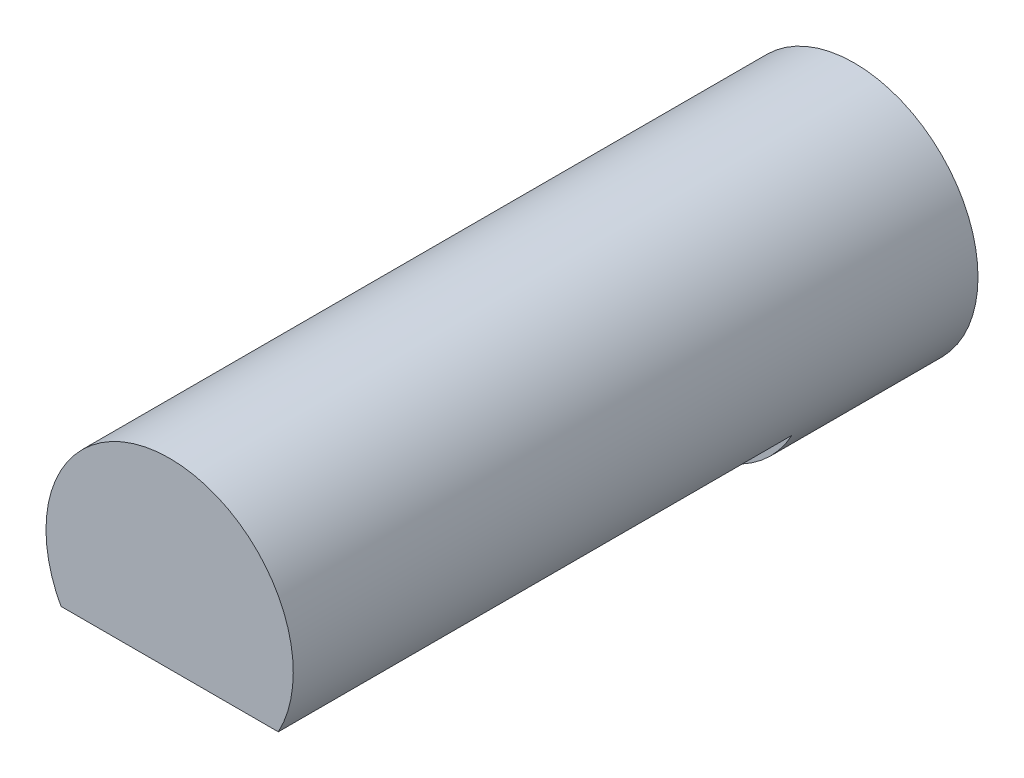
from build123d import *

# Parameters (mm, degrees)
ESQUISSE1_R             = 3.25
EXTRUSION1_DEPTH        = 18
ENL_V_START             = -13.5
ENL_V_MAT_EXTRU_1_DEPTH = 13.5


with BuildPart() as part:
    # Esquisse1 → Extrusion1 (new body)
    with BuildSketch(Plane.XY):
        Circle(ESQUISSE1_R)
    extrude(amount=EXTRUSION1_DEPTH)

    # Esquisse2 → Enl_v. mat.-Extru.1 (cut)
    with BuildSketch(Plane.XY.offset(18).offset(ENL_V_START)):
        with BuildLine():
            Line((2.856571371, -1.55), (-2.856571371, -1.55))
            ThreePointArc((-2.856571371, -1.55), (0, -3.25), (2.856571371, -1.55))
        make_face()
    extrude(amount=ENL_V_MAT_EXTRU_1_DEPTH, mode=Mode.SUBTRACT)


solid = part.part
